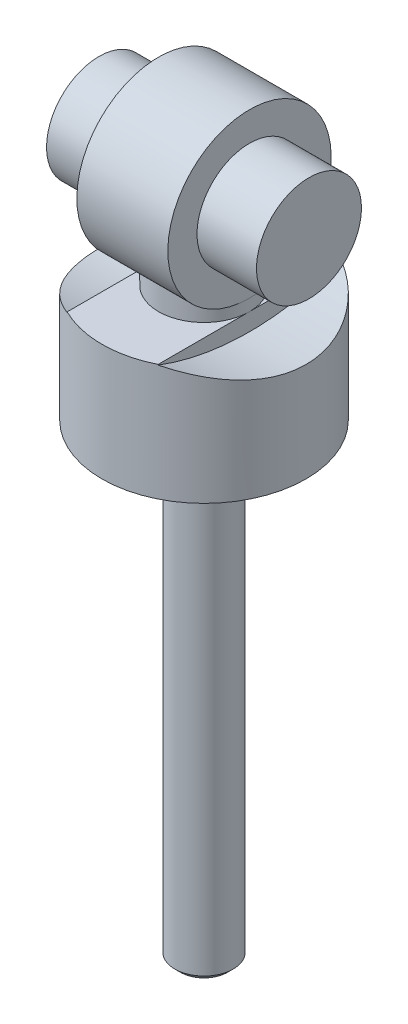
ISO-10303-21;
HEADER;
FILE_DESCRIPTION(('STEP AP214'),'2;1');
FILE_NAME('part.step','',(''),(''),'','','');
FILE_SCHEMA(('AUTOMOTIVE_DESIGN { 1 0 10303 214 1 1 1 1 }'));
ENDSEC;
DATA;
#1=APPLICATION_CONTEXT('core data for automotive mechanical design processes');
#2=APPLICATION_PROTOCOL_DEFINITION('international standard','automotive_design',2000,#1);
#3=PRODUCT_CONTEXT('',#1,'mechanical');
#4=PRODUCT('Part','Part','',(#3));
#5=PRODUCT_RELATED_PRODUCT_CATEGORY('part','',(#4));
#6=PRODUCT_DEFINITION_FORMATION('','',#4);
#7=PRODUCT_DEFINITION_CONTEXT('part definition',#1,'design');
#8=PRODUCT_DEFINITION('design','',#6,#7);
#9=PRODUCT_DEFINITION_SHAPE('','',#8);
#10=(LENGTH_UNIT() NAMED_UNIT(*) SI_UNIT(.MILLI.,.METRE.));
#11=(NAMED_UNIT(*) PLANE_ANGLE_UNIT() SI_UNIT($,.RADIAN.));
#12=(NAMED_UNIT(*) SI_UNIT($,.STERADIAN.) SOLID_ANGLE_UNIT());
#13=UNCERTAINTY_MEASURE_WITH_UNIT(LENGTH_MEASURE(1.E-05),#10,'distance_accuracy_value','');
#14=(GEOMETRIC_REPRESENTATION_CONTEXT(3) GLOBAL_UNCERTAINTY_ASSIGNED_CONTEXT((#13)) GLOBAL_UNIT_ASSIGNED_CONTEXT((#10,
#11,#12)) REPRESENTATION_CONTEXT('',''));
#15=CARTESIAN_POINT('',(0.,0.,0.));
#16=DIRECTION('',(0.,0.,1.));
#17=DIRECTION('',(1.,0.,0.));
#18=AXIS2_PLACEMENT_3D('',#15,#16,#17);
#19=CARTESIAN_POINT('',(0.,-18.,0.));
#20=DIRECTION('',(0.,-1.,0.));
#21=DIRECTION('',(0.,0.,-1.));
#22=AXIS2_PLACEMENT_3D('',#19,#20,#21);
#23=CYLINDRICAL_SURFACE('',#22,8.75);
#24=CARTESIAN_POINT('',(0.,-18.,0.));
#25=DIRECTION('',(0.,-1.,0.));
#26=DIRECTION('',(0.,0.,-1.));
#27=AXIS2_PLACEMENT_3D('',#24,#25,#26);
#28=CIRCLE('',#27,8.75);
#29=CARTESIAN_POINT('',(0.,-18.,-8.75));
#30=VERTEX_POINT('',#29);
#31=EDGE_CURVE('E154',#30,#30,#28,.T.);
#32=ORIENTED_EDGE('',*,*,#31,.F.);
#33=EDGE_LOOP('',(#32));
#34=FACE_BOUND('',#33,.T.);
#35=DIRECTION('',(0.,-1.,0.));
#36=VECTOR('',#35,1.);
#37=CARTESIAN_POINT('',(3.9,-18.,7.83278366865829));
#38=LINE('',#37,#36);
#39=CARTESIAN_POINT('',(3.9,-8.,7.83278366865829));
#40=VERTEX_POINT('',#39);
#41=CARTESIAN_POINT('',(3.9,-8.05467298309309,7.83278366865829));
#42=VERTEX_POINT('',#41);
#43=EDGE_CURVE('E158',#40,#42,#38,.T.);
#44=ORIENTED_EDGE('',*,*,#43,.F.);
#45=CARTESIAN_POINT('',(0.,-8.,0.));
#46=DIRECTION('',(0.,-1.,0.));
#47=DIRECTION('',(0.,0.,-1.));
#48=AXIS2_PLACEMENT_3D('',#45,#46,#47);
#49=CIRCLE('',#48,8.75);
#50=CARTESIAN_POINT('',(-3.9,-8.,7.83278366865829));
#51=VERTEX_POINT('',#50);
#52=EDGE_CURVE('E161',#40,#51,#49,.T.);
#53=ORIENTED_EDGE('',*,*,#52,.T.);
#54=DIRECTION('',(0.,-1.,0.));
#55=VECTOR('',#54,1.);
#56=CARTESIAN_POINT('',(-3.9,-18.,7.83278366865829));
#57=LINE('',#56,#55);
#58=CARTESIAN_POINT('',(-3.9,-8.05467298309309,7.83278366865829));
#59=VERTEX_POINT('',#58);
#60=EDGE_CURVE('E252',#59,#51,#57,.F.);
#61=ORIENTED_EDGE('',*,*,#60,.F.);
#62=CARTESIAN_POINT('',(-3.9,-8.05467298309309,-7.83278366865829));
#63=CARTESIAN_POINT('',(-4.12452384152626,-8.09737217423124,-7.721006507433));
#64=CARTESIAN_POINT('',(-4.34380093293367,-8.1426514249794,-7.5997666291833));
#65=CARTESIAN_POINT('',(-4.77055982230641,-8.23689755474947,-7.33939091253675));
#66=CARTESIAN_POINT('',(-4.97804428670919,-8.28586359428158,-7.20025914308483));
#67=CARTESIAN_POINT('',(-5.38011565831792,-8.38605555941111,-6.90500663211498));
#68=CARTESIAN_POINT('',(-5.57469632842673,-8.43728255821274,-6.74887776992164));
#69=CARTESIAN_POINT('',(-5.94972754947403,-8.54050248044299,-6.42069527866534));
#70=CARTESIAN_POINT('',(-6.13017736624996,-8.59249544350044,-6.24864082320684));
#71=CARTESIAN_POINT('',(-6.4758207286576,-8.69578877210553,-5.88967916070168));
#72=CARTESIAN_POINT('',(-6.64101593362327,-8.74708921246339,-5.7027735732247));
#73=CARTESIAN_POINT('',(-6.95509462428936,-8.8475918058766,-5.31520163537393));
#74=CARTESIAN_POINT('',(-7.10397859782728,-8.89679402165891,-5.11453569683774));
#75=CARTESIAN_POINT('',(-7.3843624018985,-8.99174565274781,-4.70065534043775));
#76=CARTESIAN_POINT('',(-7.51586399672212,-9.03749541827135,-4.4874421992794));
#77=CARTESIAN_POINT('',(-7.76039107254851,-9.12425375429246,-4.04988941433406));
#78=CARTESIAN_POINT('',(-7.87342610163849,-9.16526477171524,-3.82555559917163));
#79=CARTESIAN_POINT('',(-8.07907473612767,-9.24103260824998,-3.36942343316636));
#80=CARTESIAN_POINT('',(-8.17187940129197,-9.2758473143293,-3.13772094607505));
#81=CARTESIAN_POINT('',(-8.33757753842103,-9.33872146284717,-2.66640099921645));
#82=CARTESIAN_POINT('',(-8.41047104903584,-9.36678091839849,-2.42678355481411));
#83=CARTESIAN_POINT('',(-8.5355569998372,-9.41531310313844,-1.94152657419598));
#84=CARTESIAN_POINT('',(-8.58775595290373,-9.43578821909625,-1.69588895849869));
#85=CARTESIAN_POINT('',(-8.67089101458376,-9.46854701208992,-1.2005061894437));
#86=CARTESIAN_POINT('',(-8.70182846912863,-9.48083120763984,-0.950761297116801));
#87=CARTESIAN_POINT('',(-8.7407495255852,-9.49630702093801,-0.4658358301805));
#88=CARTESIAN_POINT('',(-8.750113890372,-9.50004546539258,-0.2307824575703));
#89=CARTESIAN_POINT('',(-8.7498840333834,-9.49995370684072,0.239307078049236));
#90=CARTESIAN_POINT('',(-8.7402907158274,-9.49612386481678,0.474343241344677));
#91=CARTESIAN_POINT('',(-8.70225130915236,-9.48100009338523,0.942599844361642));
#92=CARTESIAN_POINT('',(-8.67380828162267,-9.46970737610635,1.17582057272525));
#93=CARTESIAN_POINT('',(-8.59836743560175,-9.43996057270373,1.63877460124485));
#94=CARTESIAN_POINT('',(-8.55136958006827,-9.42150647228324,1.86850789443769));
#95=CARTESIAN_POINT('',(-8.44061471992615,-9.37843869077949,2.31748063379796));
#96=CARTESIAN_POINT('',(-8.37728079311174,-9.35398116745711,2.53683975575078));
#97=CARTESIAN_POINT('',(-8.23390957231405,-9.29929221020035,2.96937079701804));
#98=CARTESIAN_POINT('',(-8.153866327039,-9.26905871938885,3.18254048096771));
#99=CARTESIAN_POINT('',(-7.9777519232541,-9.20354769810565,3.60132955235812));
#100=CARTESIAN_POINT('',(-7.88168151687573,-9.16827040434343,3.80694929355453));
#101=CARTESIAN_POINT('',(-7.67419463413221,-9.09348021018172,4.2095784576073));
#102=CARTESIAN_POINT('',(-7.56277248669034,-9.05396574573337,4.40658466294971));
#103=CARTESIAN_POINT('',(-7.31951823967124,-8.96958509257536,4.80034457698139));
#104=CARTESIAN_POINT('',(-7.18695156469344,-8.92455123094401,4.99660873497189));
#105=CARTESIAN_POINT('',(-6.90662819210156,-8.83192026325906,5.37744590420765));
#106=CARTESIAN_POINT('',(-6.75886512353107,-8.78432208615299,5.5620139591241));
#107=CARTESIAN_POINT('',(-6.4491916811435,-8.68777999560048,5.91828375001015));
#108=CARTESIAN_POINT('',(-6.28729068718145,-8.63883698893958,6.08999387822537));
#109=CARTESIAN_POINT('',(-5.95018583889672,-8.54078643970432,6.4197690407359));
#110=CARTESIAN_POINT('',(-5.77497970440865,-8.4916788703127,6.5778317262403));
#111=CARTESIAN_POINT('',(-5.33439681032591,-8.37371263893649,6.94407214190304));
#112=CARTESIAN_POINT('',(-5.06252636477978,-8.30539786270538,7.14473831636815));
#113=CARTESIAN_POINT('',(-4.63830883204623,-8.20738306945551,7.42139553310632));
#114=CARTESIAN_POINT('',(-4.49422811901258,-8.17546615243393,7.50952743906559));
#115=CARTESIAN_POINT('',(-4.20090392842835,-8.11353556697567,7.67746300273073));
#116=CARTESIAN_POINT('',(-4.05166060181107,-8.08352184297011,7.7572669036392));
#117=CARTESIAN_POINT('',(-3.9,-8.0546729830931,7.83278366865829));
#118=B_SPLINE_CURVE_WITH_KNOTS('',3,(#62,#63,#64,#65,#66,#67,#68,#69,#70,#71,#72,#73,#74,#75,
#76,#77,#78,#79,#80,#81,#82,#83,#84,#85,#86,#87,#88,#89,#90,#91,#92,#93,#94,#95,#96,#97,#98,#99,
#100,#101,#102,#103,#104,#105,#106,#107,#108,#109,#110,#111,#112,#113,#114,#115,#116,#117),
.UNSPECIFIED.,.F.,.F.,(4,2,2,2,2,2,2,2,2,2,2,2,2,2,2,2,2,2,2,2,2,2,2,2,2,2,2,4),(0.,
0.762954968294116,1.5257367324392,2.28888454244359,3.0520719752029,3.81517629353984,
4.57825778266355,5.34126176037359,6.10386997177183,6.85892977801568,7.61398811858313,
8.36880864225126,9.1235813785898,9.82851622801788,10.5334174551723,11.2382042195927,
11.9429923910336,12.6310960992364,13.3194453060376,14.0077622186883,14.6963340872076,
15.4187923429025,16.14155472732,16.8638411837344,17.5862517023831,18.6179068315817,
19.1333253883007,19.6487288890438),.UNSPECIFIED.);
#119=CARTESIAN_POINT('',(-3.9,-8.05467298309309,-7.83278366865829));
#120=VERTEX_POINT('',#119);
#121=EDGE_CURVE('E109',#120,#59,#118,.T.);
#122=ORIENTED_EDGE('',*,*,#121,.F.);
#123=DIRECTION('',(0.,-1.,0.));
#124=VECTOR('',#123,1.);
#125=CARTESIAN_POINT('',(-3.9,-18.,-7.83278366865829));
#126=LINE('',#125,#124);
#127=CARTESIAN_POINT('',(-3.9,-8.,-7.83278366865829));
#128=VERTEX_POINT('',#127);
#129=EDGE_CURVE('E247',#128,#120,#126,.T.);
#130=ORIENTED_EDGE('',*,*,#129,.F.);
#131=CARTESIAN_POINT('',(3.9,-8.,-7.83278366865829));
#132=VERTEX_POINT('',#131);
#133=EDGE_CURVE('E172',#128,#132,#49,.T.);
#134=ORIENTED_EDGE('',*,*,#133,.T.);
#135=DIRECTION('',(0.,-1.,0.));
#136=VECTOR('',#135,1.);
#137=CARTESIAN_POINT('',(3.9,-18.,-7.83278366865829));
#138=LINE('',#137,#136);
#139=CARTESIAN_POINT('',(3.9,-8.05467298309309,-7.83278366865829));
#140=VERTEX_POINT('',#139);
#141=EDGE_CURVE('E165',#140,#132,#138,.F.);
#142=ORIENTED_EDGE('',*,*,#141,.F.);
#143=CARTESIAN_POINT('',(3.9,-8.05467298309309,7.83278366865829));
#144=CARTESIAN_POINT('',(4.12452384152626,-8.09737217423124,7.721006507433));
#145=CARTESIAN_POINT('',(4.34380093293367,-8.1426514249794,7.5997666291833));
#146=CARTESIAN_POINT('',(4.77055982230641,-8.23689755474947,7.33939091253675));
#147=CARTESIAN_POINT('',(4.97804428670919,-8.28586359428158,7.20025914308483));
#148=CARTESIAN_POINT('',(5.38011565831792,-8.38605555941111,6.90500663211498));
#149=CARTESIAN_POINT('',(5.57469632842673,-8.43728255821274,6.74887776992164));
#150=CARTESIAN_POINT('',(5.94972754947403,-8.54050248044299,6.42069527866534));
#151=CARTESIAN_POINT('',(6.13017736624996,-8.59249544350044,6.24864082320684));
#152=CARTESIAN_POINT('',(6.4758207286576,-8.69578877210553,5.88967916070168));
#153=CARTESIAN_POINT('',(6.64101593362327,-8.74708921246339,5.7027735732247));
#154=CARTESIAN_POINT('',(6.95509462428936,-8.8475918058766,5.31520163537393));
#155=CARTESIAN_POINT('',(7.10397859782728,-8.89679402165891,5.11453569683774));
#156=CARTESIAN_POINT('',(7.3843624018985,-8.99174565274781,4.70065534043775));
#157=CARTESIAN_POINT('',(7.51586399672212,-9.03749541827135,4.4874421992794));
#158=CARTESIAN_POINT('',(7.76039107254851,-9.12425375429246,4.04988941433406));
#159=CARTESIAN_POINT('',(7.87342610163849,-9.16526477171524,3.82555559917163));
#160=CARTESIAN_POINT('',(8.07907473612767,-9.24103260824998,3.36942343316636));
#161=CARTESIAN_POINT('',(8.17187940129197,-9.2758473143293,3.13772094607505));
#162=CARTESIAN_POINT('',(8.33757753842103,-9.33872146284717,2.66640099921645));
#163=CARTESIAN_POINT('',(8.41047104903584,-9.36678091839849,2.42678355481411));
#164=CARTESIAN_POINT('',(8.5355569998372,-9.41531310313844,1.94152657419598));
#165=CARTESIAN_POINT('',(8.58775595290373,-9.43578821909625,1.69588895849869));
#166=CARTESIAN_POINT('',(8.67089101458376,-9.46854701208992,1.2005061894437));
#167=CARTESIAN_POINT('',(8.70182846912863,-9.48083120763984,0.950761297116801));
#168=CARTESIAN_POINT('',(8.7407495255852,-9.49630702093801,0.4658358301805));
#169=CARTESIAN_POINT('',(8.750113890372,-9.50004546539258,0.2307824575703));
#170=CARTESIAN_POINT('',(8.7498840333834,-9.49995370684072,-0.239307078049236));
#171=CARTESIAN_POINT('',(8.7402907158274,-9.49612386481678,-0.474343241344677));
#172=CARTESIAN_POINT('',(8.70225130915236,-9.48100009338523,-0.942599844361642));
#173=CARTESIAN_POINT('',(8.67380828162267,-9.46970737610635,-1.17582057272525));
#174=CARTESIAN_POINT('',(8.59836743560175,-9.43996057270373,-1.63877460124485));
#175=CARTESIAN_POINT('',(8.55136958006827,-9.42150647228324,-1.86850789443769));
#176=CARTESIAN_POINT('',(8.44061471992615,-9.37843869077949,-2.31748063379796));
#177=CARTESIAN_POINT('',(8.37728079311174,-9.35398116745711,-2.53683975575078));
#178=CARTESIAN_POINT('',(8.23390957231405,-9.29929221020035,-2.96937079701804));
#179=CARTESIAN_POINT('',(8.153866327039,-9.26905871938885,-3.18254048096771));
#180=CARTESIAN_POINT('',(7.9777519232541,-9.20354769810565,-3.60132955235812));
#181=CARTESIAN_POINT('',(7.88168151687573,-9.16827040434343,-3.80694929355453));
#182=CARTESIAN_POINT('',(7.67419463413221,-9.09348021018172,-4.2095784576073));
#183=CARTESIAN_POINT('',(7.56277248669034,-9.05396574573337,-4.40658466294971));
#184=CARTESIAN_POINT('',(7.31951823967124,-8.96958509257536,-4.80034457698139));
#185=CARTESIAN_POINT('',(7.18695156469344,-8.92455123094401,-4.99660873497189));
#186=CARTESIAN_POINT('',(6.90662819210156,-8.83192026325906,-5.37744590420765));
#187=CARTESIAN_POINT('',(6.75886512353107,-8.78432208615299,-5.5620139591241));
#188=CARTESIAN_POINT('',(6.4491916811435,-8.68777999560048,-5.91828375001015));
#189=CARTESIAN_POINT('',(6.28729068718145,-8.63883698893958,-6.08999387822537));
#190=CARTESIAN_POINT('',(5.95018583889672,-8.54078643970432,-6.4197690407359));
#191=CARTESIAN_POINT('',(5.77497970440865,-8.4916788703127,-6.5778317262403));
#192=CARTESIAN_POINT('',(5.33439681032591,-8.37371263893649,-6.94407214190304));
#193=CARTESIAN_POINT('',(5.06252636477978,-8.30539786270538,-7.14473831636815));
#194=CARTESIAN_POINT('',(4.63830883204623,-8.20738306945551,-7.42139553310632));
#195=CARTESIAN_POINT('',(4.49422811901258,-8.17546615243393,-7.50952743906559));
#196=CARTESIAN_POINT('',(4.20090392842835,-8.11353556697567,-7.67746300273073));
#197=CARTESIAN_POINT('',(4.05166060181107,-8.08352184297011,-7.7572669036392));
#198=CARTESIAN_POINT('',(3.9,-8.0546729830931,-7.83278366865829));
#199=B_SPLINE_CURVE_WITH_KNOTS('',3,(#143,#144,#145,#146,#147,#148,#149,#150,#151,#152,#153,
#154,#155,#156,#157,#158,#159,#160,#161,#162,#163,#164,#165,#166,#167,#168,#169,#170,#171,#172,
#173,#174,#175,#176,#177,#178,#179,#180,#181,#182,#183,#184,#185,#186,#187,#188,#189,#190,#191,
#192,#193,#194,#195,#196,#197,#198),.UNSPECIFIED.,.F.,.F.,(4,2,2,2,2,2,2,2,2,2,2,2,2,2,2,2,2,2,
2,2,2,2,2,2,2,2,2,4),(0.,0.762954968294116,1.5257367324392,2.28888454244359,3.0520719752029,
3.81517629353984,4.57825778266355,5.34126176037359,6.10386997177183,6.85892977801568,
7.61398811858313,8.36880864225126,9.1235813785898,9.82851622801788,10.5334174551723,
11.2382042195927,11.9429923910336,12.6310960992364,13.3194453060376,14.0077622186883,
14.6963340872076,15.4187923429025,16.14155472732,16.8638411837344,17.5862517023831,
18.6179068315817,19.1333253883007,19.6487288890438),.UNSPECIFIED.);
#200=EDGE_CURVE('E98',#42,#140,#199,.T.);
#201=ORIENTED_EDGE('',*,*,#200,.F.);
#202=EDGE_LOOP('',(#44,#53,#61,#122,#130,#134,#142,#201));
#203=FACE_BOUND('',#202,.T.);
#204=ADVANCED_FACE('F15',(#34,#203),#23,.T.);
#205=CARTESIAN_POINT('',(0.,-8.,-3.9));
#206=DIRECTION('',(0.,-1.,0.));
#207=DIRECTION('',(0.,0.,-1.));
#208=AXIS2_PLACEMENT_3D('',#205,#206,#207);
#209=PLANE('',#208);
#210=DIRECTION('',(0.,0.,1.));
#211=VECTOR('',#210,1.);
#212=CARTESIAN_POINT('',(3.9,-8.,-3.9));
#213=LINE('',#212,#211);
#214=CARTESIAN_POINT('',(3.9,-8.,0.));
#215=VERTEX_POINT('',#214);
#216=EDGE_CURVE('E170',#215,#40,#213,.T.);
#217=ORIENTED_EDGE('',*,*,#216,.F.);
#218=CARTESIAN_POINT('',(0.,-8.,0.));
#219=DIRECTION('',(0.,-1.,0.));
#220=DIRECTION('',(0.,0.,-1.));
#221=AXIS2_PLACEMENT_3D('',#218,#219,#220);
#222=CIRCLE('',#221,3.9);
#223=CARTESIAN_POINT('',(-3.9,-8.,0.));
#224=VERTEX_POINT('',#223);
#225=EDGE_CURVE('E175',#215,#224,#222,.T.);
#226=ORIENTED_EDGE('',*,*,#225,.T.);
#227=DIRECTION('',(0.,0.,-1.));
#228=VECTOR('',#227,1.);
#229=CARTESIAN_POINT('',(-3.9,-8.,-3.9));
#230=LINE('',#229,#228);
#231=EDGE_CURVE('E171',#51,#224,#230,.T.);
#232=ORIENTED_EDGE('',*,*,#231,.F.);
#233=ORIENTED_EDGE('',*,*,#52,.F.);
#234=EDGE_LOOP('',(#217,#226,#232,#233));
#235=FACE_BOUND('',#234,.T.);
#236=ADVANCED_FACE('F144',(#235),#209,.F.);
#237=EDGE_CURVE('E251',#224,#128,#230,.T.);
#238=ORIENTED_EDGE('',*,*,#237,.F.);
#239=EDGE_CURVE('E37',#224,#215,#222,.T.);
#240=ORIENTED_EDGE('',*,*,#239,.T.);
#241=EDGE_CURVE('E260',#132,#215,#213,.T.);
#242=ORIENTED_EDGE('',*,*,#241,.F.);
#243=ORIENTED_EDGE('',*,*,#133,.F.);
#244=EDGE_LOOP('',(#238,#240,#242,#243));
#245=FACE_BOUND('',#244,.T.);
#246=ADVANCED_FACE('F149',(#245),#209,.F.);
#247=CARTESIAN_POINT('',(3.9,0.,0.));
#248=DIRECTION('',(1.,0.,0.));
#249=DIRECTION('',(0.,0.,-1.));
#250=AXIS2_PLACEMENT_3D('',#247,#248,#249);
#251=CYLINDRICAL_SURFACE('',#250,7.);
#252=CARTESIAN_POINT('',(-3.9,-7.,0.));
#253=CARTESIAN_POINT('',(-3.90000031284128,-7.0000002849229,0.101146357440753));
#254=CARTESIAN_POINT('',(-3.89606076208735,-6.99780299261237,0.202288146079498));
#255=CARTESIAN_POINT('',(-3.8803553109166,-6.98907110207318,0.4038084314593));
#256=CARTESIAN_POINT('',(-3.86858664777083,-6.98253497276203,0.504186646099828));
#257=CARTESIAN_POINT('',(-3.83737541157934,-6.96529106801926,0.70335165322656));
#258=CARTESIAN_POINT('',(-3.81793498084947,-6.95458445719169,0.802138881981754));
#259=CARTESIAN_POINT('',(-3.77162646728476,-6.92927102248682,0.997460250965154));
#260=CARTESIAN_POINT('',(-3.74475533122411,-6.91466259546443,1.09399344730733));
#261=CARTESIAN_POINT('',(-3.65367488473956,-6.8656158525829,1.37844239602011));
#262=CARTESIAN_POINT('',(-3.57884423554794,-6.82586770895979,1.56217036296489));
#263=CARTESIAN_POINT('',(-3.40371798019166,-6.73570207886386,1.91400928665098));
#264=CARTESIAN_POINT('',(-3.30341621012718,-6.68528201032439,2.08211644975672));
#265=CARTESIAN_POINT('',(-3.07231715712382,-6.57405157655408,2.41123481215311));
#266=CARTESIAN_POINT('',(-2.93988015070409,-6.51276165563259,2.57093203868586));
#267=CARTESIAN_POINT('',(-2.65187991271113,-6.38792749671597,2.86710248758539));
#268=CARTESIAN_POINT('',(-2.4962931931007,-6.32438101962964,3.00355181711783));
#269=CARTESIAN_POINT('',(-2.14756313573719,-6.19461051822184,3.26342871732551));
#270=CARTESIAN_POINT('',(-1.9522073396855,-6.12877524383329,3.38410558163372));
#271=CARTESIAN_POINT('',(-1.54017690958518,-6.01028349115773,3.59036592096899));
#272=CARTESIAN_POINT('',(-1.32353352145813,-5.95760808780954,3.67599990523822));
#273=CARTESIAN_POINT('',(-0.922013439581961,-5.88301311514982,3.79393677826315));
#274=CARTESIAN_POINT('',(-0.740093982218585,-5.85694711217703,3.83368428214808));
#275=CARTESIAN_POINT('',(-0.370897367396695,-5.82184998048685,3.88678839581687));
#276=CARTESIAN_POINT('',(-0.183625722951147,-5.81280192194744,3.9001712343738));
#277=CARTESIAN_POINT('',(0.191083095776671,-5.81303377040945,3.89982520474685));
#278=CARTESIAN_POINT('',(0.37852022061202,-5.8223342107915,3.8860659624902));
#279=CARTESIAN_POINT('',(0.747931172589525,-5.85794372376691,3.83216617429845));
#280=CARTESIAN_POINT('',(0.92990134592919,-5.88426391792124,3.79200837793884));
#281=CARTESIAN_POINT('',(1.28390008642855,-5.95046957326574,3.68723511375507));
#282=CARTESIAN_POINT('',(1.45593022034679,-5.99035288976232,3.62262351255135));
#283=CARTESIAN_POINT('',(1.78727171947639,-6.07937613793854,3.47115130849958));
#284=CARTESIAN_POINT('',(1.94657809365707,-6.12851967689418,3.3842820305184));
#285=CARTESIAN_POINT('',(2.2737904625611,-6.23962592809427,3.17538598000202));
#286=CARTESIAN_POINT('',(2.43929114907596,-6.30240002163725,3.05001538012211));
#287=CARTESIAN_POINT('',(2.74839589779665,-6.4283539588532,2.77475098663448));
#288=CARTESIAN_POINT('',(2.89198236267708,-6.49153408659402,2.62483768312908));
#289=CARTESIAN_POINT('',(3.16801707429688,-6.61889865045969,2.28605157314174));
#290=CARTESIAN_POINT('',(3.29781181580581,-6.68252127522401,2.09475977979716));
#291=CARTESIAN_POINT('',(3.46646074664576,-6.76786771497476,1.79084562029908));
#292=CARTESIAN_POINT('',(3.51835131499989,-6.79464354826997,1.68666859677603));
#293=CARTESIAN_POINT('',(3.612893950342,-6.84407556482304,1.47329042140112));
#294=CARTESIAN_POINT('',(3.65555155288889,-6.8667342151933,1.36409232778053));
#295=CARTESIAN_POINT('',(3.72840544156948,-6.90580423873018,1.14932095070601));
#296=CARTESIAN_POINT('',(3.75926673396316,-6.92254271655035,1.04403213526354));
#297=CARTESIAN_POINT('',(3.81209300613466,-6.95137123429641,0.830670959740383));
#298=CARTESIAN_POINT('',(3.83406268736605,-6.96346373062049,0.722600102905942));
#299=CARTESIAN_POINT('',(3.868792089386,-6.9826458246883,0.504603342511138));
#300=CARTESIAN_POINT('',(3.88155641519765,-6.9897379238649,0.394678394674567));
#301=CARTESIAN_POINT('',(3.89769038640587,-6.99871019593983,0.173933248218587));
#302=CARTESIAN_POINT('',(3.90106096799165,-7.00059088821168,0.0631131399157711));
#303=CARTESIAN_POINT('',(3.89851220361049,-6.9991712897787,-0.145684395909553));
#304=CARTESIAN_POINT('',(3.8936119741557,-6.99643934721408,-0.243680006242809));
#305=CARTESIAN_POINT('',(3.87646786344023,-6.98691292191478,-0.438858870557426));
#306=CARTESIAN_POINT('',(3.86422167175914,-6.98011716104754,-0.536041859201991));
#307=CARTESIAN_POINT('',(3.8325365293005,-6.96262599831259,-0.728834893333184));
#308=CARTESIAN_POINT('',(3.81310029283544,-6.95193206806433,-0.824445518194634));
#309=CARTESIAN_POINT('',(3.7672642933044,-6.92689811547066,-1.01350789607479));
#310=CARTESIAN_POINT('',(3.7408618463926,-6.91255668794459,-1.10695880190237));
#311=CARTESIAN_POINT('',(3.65188020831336,-6.86467000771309,-1.38231185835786));
#312=CARTESIAN_POINT('',(3.5793522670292,-6.82616282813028,-1.56025439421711));
#313=CARTESIAN_POINT('',(3.41035528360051,-6.73908732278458,-1.90153537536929));
#314=CARTESIAN_POINT('',(3.31387989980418,-6.69051633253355,-2.06486993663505));
#315=CARTESIAN_POINT('',(3.0884274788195,-6.58161394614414,-2.39055758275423));
#316=CARTESIAN_POINT('',(2.95712331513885,-6.52058610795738,-2.5510686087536));
#317=CARTESIAN_POINT('',(2.67130243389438,-6.39603792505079,-2.8490076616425));
#318=CARTESIAN_POINT('',(2.51676008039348,-6.33251488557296,-2.98640983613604));
#319=CARTESIAN_POINT('',(2.17019140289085,-6.20252665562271,-3.24840604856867));
#320=CARTESIAN_POINT('',(1.97595074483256,-6.13642030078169,-3.37027211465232));
#321=CARTESIAN_POINT('',(1.5660225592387,-6.0169979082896,-3.57914696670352));
#322=CARTESIAN_POINT('',(1.35036576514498,-5.96366390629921,-3.66620482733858));
#323=CARTESIAN_POINT('',(0.949863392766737,-5.88745193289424,-3.78707116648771));
#324=CARTESIAN_POINT('',(0.767997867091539,-5.86053840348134,-3.82820584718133));
#325=CARTESIAN_POINT('',(0.398636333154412,-5.82368322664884,-3.88405483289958));
#326=CARTESIAN_POINT('',(0.211146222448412,-5.81372439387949,-3.89879589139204));
#327=CARTESIAN_POINT('',(-0.16431738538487,-5.81220321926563,-3.90106353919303));
#328=CARTESIAN_POINT('',(-0.352291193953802,-5.82066508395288,-3.88855431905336));
#329=CARTESIAN_POINT('',(-0.722985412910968,-5.85478864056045,-3.83697351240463));
#330=CARTESIAN_POINT('',(-0.905702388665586,-5.88046132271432,-3.79788495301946));
#331=CARTESIAN_POINT('',(-1.26056326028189,-5.94547234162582,-3.69526481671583));
#332=CARTESIAN_POINT('',(-1.43274964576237,-5.98475081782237,-3.63184018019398));
#333=CARTESIAN_POINT('',(-1.76456240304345,-6.07272836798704,-3.48273610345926));
#334=CARTESIAN_POINT('',(-1.92418392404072,-6.12143105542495,-3.39704812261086));
#335=CARTESIAN_POINT('',(-2.25197054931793,-6.23169761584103,-3.1908552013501));
#336=CARTESIAN_POINT('',(-2.41778139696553,-6.29409283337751,-3.06704558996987));
#337=CARTESIAN_POINT('',(-2.72777488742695,-6.41955139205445,-2.79497203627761));
#338=CARTESIAN_POINT('',(-2.87193982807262,-6.48261523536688,-2.64668828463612));
#339=CARTESIAN_POINT('',(-3.14998913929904,-6.61026335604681,-2.31081364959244));
#340=CARTESIAN_POINT('',(-3.28116085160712,-6.67429932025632,-2.12072173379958));
#341=CARTESIAN_POINT('',(-3.45204991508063,-6.76049282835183,-1.81846116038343));
#342=CARTESIAN_POINT('',(-3.50471596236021,-6.787588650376,-1.71481303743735));
#343=CARTESIAN_POINT('',(-3.60086999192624,-6.83773159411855,-1.5024293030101));
#344=CARTESIAN_POINT('',(-3.64436349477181,-6.86078114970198,-1.39369680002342));
#345=CARTESIAN_POINT('',(-3.71848344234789,-6.90045090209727,-1.18090483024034));
#346=CARTESIAN_POINT('',(-3.74986495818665,-6.91743981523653,-1.07717625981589));
#347=CARTESIAN_POINT('',(-3.80397740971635,-6.94692221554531,-0.866908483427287));
#348=CARTESIAN_POINT('',(-3.8267128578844,-6.95941804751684,-0.760370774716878));
#349=CARTESIAN_POINT('',(-3.86321922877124,-6.97955808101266,-0.545364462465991));
#350=CARTESIAN_POINT('',(-3.87699416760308,-6.98720445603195,-0.436896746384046));
#351=CARTESIAN_POINT('',(-3.89538409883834,-6.99742510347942,-0.218950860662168));
#352=CARTESIAN_POINT('',(-3.89999966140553,-6.99999969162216,-0.109472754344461));
#353=CARTESIAN_POINT('',(-3.9,-7.,0.));
#354=B_SPLINE_CURVE_WITH_KNOTS('',3,(#252,#253,#254,#255,#256,#257,#258,#259,#260,#261,#262,
#263,#264,#265,#266,#267,#268,#269,#270,#271,#272,#273,#274,#275,#276,#277,#278,#279,#280,#281,
#282,#283,#284,#285,#286,#287,#288,#289,#290,#291,#292,#293,#294,#295,#296,#297,#298,#299,#300,
#301,#302,#303,#304,#305,#306,#307,#308,#309,#310,#311,#312,#313,#314,#315,#316,#317,#318,#319,
#320,#321,#322,#323,#324,#325,#326,#327,#328,#329,#330,#331,#332,#333,#334,#335,#336,#337,#338,
#339,#340,#341,#342,#343,#344,#345,#346,#347,#348,#349,#350,#351,#352,#353),.UNSPECIFIED.,.T.,
.F.,(4,2,2,2,2,2,2,2,2,2,2,2,2,2,2,2,2,2,2,2,2,2,2,2,2,2,2,2,2,2,2,2,2,2,2,2,2,2,2,2,2,2,2,2,2,
2,2,2,2,2,4),(0.,0.303330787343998,0.606768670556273,0.910121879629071,1.21359992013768,
1.81765602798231,2.42185845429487,3.06822728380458,3.71525645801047,4.42832801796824,
5.14036813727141,5.70199096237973,6.26305477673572,6.82474682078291,7.38680627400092,
7.94877689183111,8.51096687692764,9.15905767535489,9.80766618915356,10.5228095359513,
10.8806537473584,11.2382828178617,11.5707819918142,11.903105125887,12.2352618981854,
12.5673855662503,12.8614963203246,13.1556996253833,13.4497919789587,13.7439978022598,
14.3292696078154,14.9146965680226,15.5605601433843,16.2071415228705,16.9195476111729,
17.6309457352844,18.1936677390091,18.7558190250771,19.3187094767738,19.8819597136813,
20.4427626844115,21.0037811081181,21.6495812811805,22.2959067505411,23.0107914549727,
23.3684940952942,23.7259808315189,24.0546214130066,24.383090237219,24.7114117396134,
25.0397128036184),.UNSPECIFIED.);
#355=CARTESIAN_POINT('',(3.9,-7.,0.));
#356=VERTEX_POINT('',#355);
#357=CARTESIAN_POINT('',(-3.9,-7.,0.));
#358=VERTEX_POINT('',#357);
#359=EDGE_CURVE('E187',#356,#358,#354,.T.);
#360=ORIENTED_EDGE('',*,*,#359,.T.);
#361=CARTESIAN_POINT('',(-3.9,0.,0.));
#362=DIRECTION('',(1.,0.,0.));
#363=DIRECTION('',(0.,0.,-1.));
#364=AXIS2_PLACEMENT_3D('',#361,#362,#363);
#365=CIRCLE('',#364,7.);
#366=EDGE_CURVE('E179',#358,#358,#365,.T.);
#367=ORIENTED_EDGE('',*,*,#366,.T.);
#368=EDGE_CURVE('E193',#358,#356,#354,.T.);
#369=ORIENTED_EDGE('',*,*,#368,.T.);
#370=CARTESIAN_POINT('',(3.9,0.,0.));
#371=DIRECTION('',(1.,0.,0.));
#372=DIRECTION('',(0.,0.,-1.));
#373=AXIS2_PLACEMENT_3D('',#370,#371,#372);
#374=CIRCLE('',#373,7.);
#375=EDGE_CURVE('E182',#356,#356,#374,.T.);
#376=ORIENTED_EDGE('',*,*,#375,.F.);
#377=EDGE_LOOP('',(#360,#367,#369,#376));
#378=FACE_BOUND('',#377,.T.);
#379=ADVANCED_FACE('F194',(#378),#251,.T.);
#380=CARTESIAN_POINT('',(-3.9,7.,0.));
#381=DIRECTION('',(-1.,0.,0.));
#382=DIRECTION('',(0.,0.,1.));
#383=AXIS2_PLACEMENT_3D('',#380,#381,#382);
#384=PLANE('',#383);
#385=CARTESIAN_POINT('',(-3.9,0.,0.));
#386=DIRECTION('',(-1.,0.,0.));
#387=DIRECTION('',(0.,0.,1.));
#388=AXIS2_PLACEMENT_3D('',#385,#386,#387);
#389=CIRCLE('',#388,4.5);
#390=CARTESIAN_POINT('',(-3.9,0.,4.5));
#391=VERTEX_POINT('',#390);
#392=EDGE_CURVE('E279',#391,#391,#389,.F.);
#393=ORIENTED_EDGE('',*,*,#392,.T.);
#394=EDGE_LOOP('',(#393));
#395=FACE_BOUND('',#394,.T.);
#396=ORIENTED_EDGE('',*,*,#366,.F.);
#397=EDGE_LOOP('',(#396));
#398=FACE_BOUND('',#397,.T.);
#399=ADVANCED_FACE('F17',(#395,#398),#384,.T.);
#400=CARTESIAN_POINT('',(3.9,4.5,0.));
#401=DIRECTION('',(1.,0.,0.));
#402=DIRECTION('',(0.,0.,-1.));
#403=AXIS2_PLACEMENT_3D('',#400,#401,#402);
#404=PLANE('',#403);
#405=ORIENTED_EDGE('',*,*,#375,.T.);
#406=EDGE_LOOP('',(#405));
#407=FACE_BOUND('',#406,.T.);
#408=CARTESIAN_POINT('',(3.9,0.,0.));
#409=DIRECTION('',(1.,0.,0.));
#410=DIRECTION('',(0.,0.,-1.));
#411=AXIS2_PLACEMENT_3D('',#408,#409,#410);
#412=CIRCLE('',#411,4.5);
#413=CARTESIAN_POINT('',(3.9,0.,-4.5));
#414=VERTEX_POINT('',#413);
#415=EDGE_CURVE('E185',#414,#414,#412,.T.);
#416=ORIENTED_EDGE('',*,*,#415,.F.);
#417=EDGE_LOOP('',(#416));
#418=FACE_BOUND('',#417,.T.);
#419=ADVANCED_FACE('F130',(#407,#418),#404,.T.);
#420=CARTESIAN_POINT('',(0.,-18.,-8.75));
#421=DIRECTION('',(0.,1.,0.));
#422=DIRECTION('',(0.,0.,1.));
#423=AXIS2_PLACEMENT_3D('',#420,#421,#422);
#424=PLANE('',#423);
#425=CARTESIAN_POINT('',(0.,-18.,0.));
#426=DIRECTION('',(0.,-1.,0.));
#427=DIRECTION('',(0.,0.,-1.));
#428=AXIS2_PLACEMENT_3D('',#425,#426,#427);
#429=CIRCLE('',#428,2.5);
#430=CARTESIAN_POINT('',(0.,-18.,-2.5));
#431=VERTEX_POINT('',#430);
#432=EDGE_CURVE('E285',#431,#431,#429,.T.);
#433=ORIENTED_EDGE('',*,*,#432,.F.);
#434=EDGE_LOOP('',(#433));
#435=FACE_BOUND('',#434,.T.);
#436=ORIENTED_EDGE('',*,*,#31,.T.);
#437=EDGE_LOOP('',(#436));
#438=FACE_BOUND('',#437,.T.);
#439=ADVANCED_FACE('F127',(#435,#438),#424,.F.);
#440=CARTESIAN_POINT('',(0.,-18.,0.));
#441=DIRECTION('',(0.,-1.,0.));
#442=DIRECTION('',(0.,0.,-1.));
#443=AXIS2_PLACEMENT_3D('',#440,#441,#442);
#444=CYLINDRICAL_SURFACE('',#443,3.9);
#445=ORIENTED_EDGE('',*,*,#239,.F.);
#446=ORIENTED_EDGE('',*,*,#225,.F.);
#447=EDGE_LOOP('',(#445,#446));
#448=FACE_BOUND('',#447,.T.);
#449=ORIENTED_EDGE('',*,*,#359,.F.);
#450=ORIENTED_EDGE('',*,*,#368,.F.);
#451=EDGE_LOOP('',(#449,#450));
#452=FACE_BOUND('',#451,.T.);
#453=ADVANCED_FACE('F129',(#448,#452),#444,.T.);
#454=CARTESIAN_POINT('',(-3.9,9.4470989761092,0.));
#455=DIRECTION('',(-1.,0.,0.));
#456=DIRECTION('',(0.,0.,1.));
#457=AXIS2_PLACEMENT_3D('',#454,#455,#456);
#458=PLANE('',#457);
#459=ORIENTED_EDGE('',*,*,#129,.T.);
#460=CARTESIAN_POINT('',(-3.9,12.4470989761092,0.));
#461=DIRECTION('',(-1.,0.,0.));
#462=DIRECTION('',(0.,0.,1.));
#463=AXIS2_PLACEMENT_3D('',#460,#461,#462);
#464=CIRCLE('',#463,21.9470989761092);
#465=EDGE_CURVE('E92',#120,#59,#464,.T.);
#466=ORIENTED_EDGE('',*,*,#465,.T.);
#467=ORIENTED_EDGE('',*,*,#60,.T.);
#468=ORIENTED_EDGE('',*,*,#231,.T.);
#469=ORIENTED_EDGE('',*,*,#237,.T.);
#470=EDGE_LOOP('',(#459,#466,#467,#468,#469));
#471=FACE_BOUND('',#470,.T.);
#472=ADVANCED_FACE('F137',(#471),#458,.T.);
#473=CARTESIAN_POINT('',(-17.5,12.4470989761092,0.));
#474=DIRECTION('',(-1.,0.,0.));
#475=DIRECTION('',(0.,0.,1.));
#476=AXIS2_PLACEMENT_3D('',#473,#474,#475);
#477=CYLINDRICAL_SURFACE('',#476,21.9470989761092);
#478=ORIENTED_EDGE('',*,*,#465,.F.);
#479=ORIENTED_EDGE('',*,*,#121,.T.);
#480=EDGE_LOOP('',(#478,#479));
#481=FACE_BOUND('',#480,.T.);
#482=ADVANCED_FACE('F124',(#481),#477,.F.);
#483=CARTESIAN_POINT('',(-17.5,12.4470989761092,0.));
#484=DIRECTION('',(-1.,0.,0.));
#485=DIRECTION('',(0.,0.,1.));
#486=AXIS2_PLACEMENT_3D('',#483,#484,#485);
#487=CYLINDRICAL_SURFACE('',#486,21.9470989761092);
#488=CARTESIAN_POINT('',(3.9,12.4470989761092,0.));
#489=DIRECTION('',(-1.,0.,0.));
#490=DIRECTION('',(0.,0.,1.));
#491=AXIS2_PLACEMENT_3D('',#488,#489,#490);
#492=CIRCLE('',#491,21.9470989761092);
#493=EDGE_CURVE('E254',#140,#42,#492,.T.);
#494=ORIENTED_EDGE('',*,*,#493,.T.);
#495=ORIENTED_EDGE('',*,*,#200,.T.);
#496=EDGE_LOOP('',(#494,#495));
#497=FACE_BOUND('',#496,.T.);
#498=ADVANCED_FACE('F119',(#497),#487,.F.);
#499=CARTESIAN_POINT('',(3.9,-9.5,0.));
#500=DIRECTION('',(1.,0.,0.));
#501=DIRECTION('',(0.,0.,-1.));
#502=AXIS2_PLACEMENT_3D('',#499,#500,#501);
#503=PLANE('',#502);
#504=ORIENTED_EDGE('',*,*,#43,.T.);
#505=ORIENTED_EDGE('',*,*,#493,.F.);
#506=ORIENTED_EDGE('',*,*,#141,.T.);
#507=ORIENTED_EDGE('',*,*,#241,.T.);
#508=ORIENTED_EDGE('',*,*,#216,.T.);
#509=EDGE_LOOP('',(#504,#505,#506,#507,#508));
#510=FACE_BOUND('',#509,.T.);
#511=ADVANCED_FACE('F123',(#510),#503,.T.);
#512=CARTESIAN_POINT('',(9.,0.,0.));
#513=DIRECTION('',(1.,0.,0.));
#514=DIRECTION('',(0.,0.,-1.));
#515=AXIS2_PLACEMENT_3D('',#512,#513,#514);
#516=PLANE('',#515);
#517=CARTESIAN_POINT('',(9.,0.,0.));
#518=DIRECTION('',(1.,0.,0.));
#519=DIRECTION('',(0.,0.,-1.));
#520=AXIS2_PLACEMENT_3D('',#517,#518,#519);
#521=CIRCLE('',#520,4.5);
#522=CARTESIAN_POINT('',(9.,0.,-4.5));
#523=VERTEX_POINT('',#522);
#524=EDGE_CURVE('E277',#523,#523,#521,.T.);
#525=ORIENTED_EDGE('',*,*,#524,.T.);
#526=EDGE_LOOP('',(#525));
#527=FACE_BOUND('',#526,.T.);
#528=ADVANCED_FACE('F274',(#527),#516,.T.);
#529=CARTESIAN_POINT('',(9.,0.,0.));
#530=DIRECTION('',(-1.,0.,0.));
#531=DIRECTION('',(0.,0.,1.));
#532=AXIS2_PLACEMENT_3D('',#529,#530,#531);
#533=CYLINDRICAL_SURFACE('',#532,4.5);
#534=ORIENTED_EDGE('',*,*,#415,.T.);
#535=EDGE_LOOP('',(#534));
#536=FACE_BOUND('',#535,.T.);
#537=ORIENTED_EDGE('',*,*,#524,.F.);
#538=EDGE_LOOP('',(#537));
#539=FACE_BOUND('',#538,.T.);
#540=ADVANCED_FACE('F270',(#536,#539),#533,.T.);
#541=ORIENTED_EDGE('',*,*,#392,.F.);
#542=EDGE_LOOP('',(#541));
#543=FACE_BOUND('',#542,.T.);
#544=CARTESIAN_POINT('',(-9.,0.,0.));
#545=DIRECTION('',(1.,0.,0.));
#546=DIRECTION('',(0.,0.,-1.));
#547=AXIS2_PLACEMENT_3D('',#544,#545,#546);
#548=CIRCLE('',#547,4.5);
#549=CARTESIAN_POINT('',(-9.,0.,-4.5));
#550=VERTEX_POINT('',#549);
#551=EDGE_CURVE('E280',#550,#550,#548,.T.);
#552=ORIENTED_EDGE('',*,*,#551,.T.);
#553=EDGE_LOOP('',(#552));
#554=FACE_BOUND('',#553,.T.);
#555=ADVANCED_FACE('F273',(#543,#554),#533,.T.);
#556=CARTESIAN_POINT('',(-9.,0.,0.));
#557=DIRECTION('',(1.,0.,0.));
#558=DIRECTION('',(0.,0.,-1.));
#559=AXIS2_PLACEMENT_3D('',#556,#557,#558);
#560=PLANE('',#559);
#561=ORIENTED_EDGE('',*,*,#551,.F.);
#562=EDGE_LOOP('',(#561));
#563=FACE_BOUND('',#562,.T.);
#564=ADVANCED_FACE('F318',(#563),#560,.F.);
#565=CARTESIAN_POINT('',(0.,-58.,-2.0095));
#566=DIRECTION('',(0.,1.,0.));
#567=DIRECTION('',(0.,0.,1.));
#568=AXIS2_PLACEMENT_3D('',#565,#566,#567);
#569=PLANE('',#568);
#570=CARTESIAN_POINT('',(0.,-58.,0.));
#571=DIRECTION('',(0.,-1.,0.));
#572=DIRECTION('',(0.,0.,-1.));
#573=AXIS2_PLACEMENT_3D('',#570,#571,#572);
#574=CIRCLE('',#573,2.0095);
#575=CARTESIAN_POINT('',(0.,-58.,-2.0095));
#576=VERTEX_POINT('',#575);
#577=EDGE_CURVE('E293',#576,#576,#574,.T.);
#578=ORIENTED_EDGE('',*,*,#577,.T.);
#579=EDGE_LOOP('',(#578));
#580=FACE_BOUND('',#579,.T.);
#581=ADVANCED_FACE('F297',(#580),#569,.F.);
#582=CARTESIAN_POINT('',(0.,-57.5095,0.));
#583=DIRECTION('',(0.,1.,0.));
#584=DIRECTION('',(0.,0.,1.));
#585=AXIS2_PLACEMENT_3D('',#582,#583,#584);
#586=CONICAL_SURFACE('',#585,2.5,0.78539816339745);
#587=ORIENTED_EDGE('',*,*,#577,.F.);
#588=EDGE_LOOP('',(#587));
#589=FACE_BOUND('',#588,.T.);
#590=CARTESIAN_POINT('',(0.,-57.5095,0.));
#591=DIRECTION('',(0.,-1.,0.));
#592=DIRECTION('',(0.,0.,-1.));
#593=AXIS2_PLACEMENT_3D('',#590,#591,#592);
#594=CIRCLE('',#593,2.5);
#595=CARTESIAN_POINT('',(0.,-57.5095,-2.5));
#596=VERTEX_POINT('',#595);
#597=EDGE_CURVE('E290',#596,#596,#594,.T.);
#598=ORIENTED_EDGE('',*,*,#597,.T.);
#599=EDGE_LOOP('',(#598));
#600=FACE_BOUND('',#599,.T.);
#601=ADVANCED_FACE('F299',(#589,#600),#586,.T.);
#602=CARTESIAN_POINT('',(0.,-58.,0.));
#603=DIRECTION('',(0.,-1.,0.));
#604=DIRECTION('',(0.,0.,-1.));
#605=AXIS2_PLACEMENT_3D('',#602,#603,#604);
#606=CYLINDRICAL_SURFACE('',#605,2.5);
#607=ORIENTED_EDGE('',*,*,#597,.F.);
#608=EDGE_LOOP('',(#607));
#609=FACE_BOUND('',#608,.T.);
#610=ORIENTED_EDGE('',*,*,#432,.T.);
#611=EDGE_LOOP('',(#610));
#612=FACE_BOUND('',#611,.T.);
#613=ADVANCED_FACE('F302',(#609,#612),#606,.T.);
#614=CLOSED_SHELL('',(#204,#236,#246,#379,#399,#419,#439,#453,#472,#482,#498,#511,#528,#540,
#555,#564,#581,#601,#613));
#615=CARTESIAN_POINT('',(0.,-3.30870065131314,-3.05));
#616=CARTESIAN_POINT('',(0.0740543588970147,-3.30870135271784,-3.04999955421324));
#617=CARTESIAN_POINT('',(0.148113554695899,-3.31120079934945,-3.04729547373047));
#618=CARTESIAN_POINT('',(0.29550128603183,-3.32105327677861,-3.03655247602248));
#619=CARTESIAN_POINT('',(0.368829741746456,-3.32840683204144,-3.02851298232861));
#620=CARTESIAN_POINT('',(0.586950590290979,-3.35728100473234,-2.99658701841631));
#621=CARTESIAN_POINT('',(0.729787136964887,-3.385614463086,-2.96489335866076));
#622=CARTESIAN_POINT('',(1.00481607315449,-3.45535402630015,-2.88328172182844));
#623=CARTESIAN_POINT('',(1.13710040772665,-3.49662694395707,-2.83354864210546));
#624=CARTESIAN_POINT('',(1.39123632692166,-3.58733287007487,-2.71780374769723));
#625=CARTESIAN_POINT('',(1.51308617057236,-3.6367672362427,-2.65178922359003));
#626=CARTESIAN_POINT('',(1.76446479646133,-3.74781440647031,-2.49293203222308));
#627=CARTESIAN_POINT('',(1.89204410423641,-3.81010328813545,-2.39747643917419));
#628=CARTESIAN_POINT('',(2.13108358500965,-3.93428541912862,-2.18776550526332));
#629=CARTESIAN_POINT('',(2.24252540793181,-3.99617814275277,-2.07348907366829));
#630=CARTESIAN_POINT('',(2.46301512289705,-4.1236708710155,-1.80832137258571));
#631=CARTESIAN_POINT('',(2.56913328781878,-4.18840811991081,-1.65450535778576));
#632=CARTESIAN_POINT('',(2.70696690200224,-4.27480018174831,-1.40843177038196));
#633=CARTESIAN_POINT('',(2.74934801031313,-4.30180769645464,-1.3238668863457));
#634=CARTESIAN_POINT('',(2.82644155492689,-4.35148238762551,-1.15011183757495));
#635=CARTESIAN_POINT('',(2.86115705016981,-4.37415129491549,-1.06092353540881));
#636=CARTESIAN_POINT('',(2.93723315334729,-4.42421178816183,-0.834029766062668));
#637=CARTESIAN_POINT('',(2.97356864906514,-4.44850916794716,-0.693888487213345));
#638=CARTESIAN_POINT('',(3.02602447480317,-4.48374237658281,-0.408328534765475));
#639=CARTESIAN_POINT('',(3.04216027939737,-4.49468843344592,-0.262913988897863));
#640=CARTESIAN_POINT('',(3.05336718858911,-4.5022807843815,0.0293654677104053));
#641=CARTESIAN_POINT('',(3.04840293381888,-4.49890307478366,0.176232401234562));
#642=CARTESIAN_POINT('',(3.01761506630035,-4.47809945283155,0.466749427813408));
#643=CARTESIAN_POINT('',(2.99178532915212,-4.46066941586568,0.610398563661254));
#644=CARTESIAN_POINT('',(2.92131598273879,-4.41371882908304,0.888013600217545));
#645=CARTESIAN_POINT('',(2.87702540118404,-4.38442289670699,1.02210773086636));
#646=CARTESIAN_POINT('',(2.77159197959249,-4.31597239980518,1.28074304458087));
#647=CARTESIAN_POINT('',(2.71044594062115,-4.27681596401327,1.40528240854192));
#648=CARTESIAN_POINT('',(2.56551457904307,-4.18638203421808,1.65649516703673));
#649=CARTESIAN_POINT('',(2.47995424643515,-4.13423576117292,1.78182668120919));
#650=CARTESIAN_POINT('',(2.29260341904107,-4.02464324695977,2.01721180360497));
#651=CARTESIAN_POINT('',(2.19079412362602,-3.96719089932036,2.12724743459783));
#652=CARTESIAN_POINT('',(1.95420691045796,-3.841187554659,2.34819750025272));
#653=CARTESIAN_POINT('',(1.81676442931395,-3.7723979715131,2.4561343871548));
#654=CARTESIAN_POINT('',(1.52359640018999,-3.64029455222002,2.64798057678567));
#655=CARTESIAN_POINT('',(1.36788117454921,-3.57697765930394,2.7319033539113));
#656=CARTESIAN_POINT('',(1.07873972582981,-3.4781328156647,2.85610629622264));
#657=CARTESIAN_POINT('',(0.948783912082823,-3.43957561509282,2.90201639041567));
#658=CARTESIAN_POINT('',(0.680934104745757,-3.37555318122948,2.97625031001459));
#659=CARTESIAN_POINT('',(0.54305511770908,-3.35006405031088,3.00460625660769));
#660=CARTESIAN_POINT('',(0.261369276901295,-3.31605166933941,3.04212029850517));
#661=CARTESIAN_POINT('',(0.117523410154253,-3.30766771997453,3.05112079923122));
#662=CARTESIAN_POINT('',(-0.169846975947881,-3.30994043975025,3.04865479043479));
#663=CARTESIAN_POINT('',(-0.313371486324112,-3.32059763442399,3.03718771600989));
#664=CARTESIAN_POINT('',(-0.579273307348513,-3.35672225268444,2.99716587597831));
#665=CARTESIAN_POINT('',(-0.702224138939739,-3.3804057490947,2.97065905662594));
#666=CARTESIAN_POINT('',(-0.941707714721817,-3.43813602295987,2.9036484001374));
#667=CARTESIAN_POINT('',(-1.05823445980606,-3.47219229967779,2.86313172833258));
#668=CARTESIAN_POINT('',(-1.33453129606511,-3.56435394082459,2.74826045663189));
#669=CARTESIAN_POINT('',(-1.49008084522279,-3.62637602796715,2.6668870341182));
#670=CARTESIAN_POINT('',(-1.78349065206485,-3.75646016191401,2.48031899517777));
#671=CARTESIAN_POINT('',(-1.9213174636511,-3.82453323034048,2.37508034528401));
#672=CARTESIAN_POINT('',(-2.17938375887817,-3.9604362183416,2.14091948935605));
#673=CARTESIAN_POINT('',(-2.29935531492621,-4.02824992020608,2.01169148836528));
#674=CARTESIAN_POINT('',(-2.51660188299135,-4.1560914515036,1.7321777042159));
#675=CARTESIAN_POINT('',(-2.61391283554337,-4.21613154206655,1.58192588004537));
#676=CARTESIAN_POINT('',(-2.7672445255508,-4.31303677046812,1.2910804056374));
#677=CARTESIAN_POINT('',(-2.82752395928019,-4.35212259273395,1.15347804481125));
#678=CARTESIAN_POINT('',(-2.92771339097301,-4.41786925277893,0.868215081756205));
#679=CARTESIAN_POINT('',(-2.96763645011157,-4.44453805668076,0.720560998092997));
#680=CARTESIAN_POINT('',(-3.02511265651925,-4.48311795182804,0.418279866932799));
#681=CARTESIAN_POINT('',(-3.04255880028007,-4.49495844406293,0.263623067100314));
#682=CARTESIAN_POINT('',(-3.05359112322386,-4.50243250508,-0.0469294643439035));
#683=CARTESIAN_POINT('',(-3.04718207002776,-4.49806931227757,-0.202824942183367));
#684=CARTESIAN_POINT('',(-3.01241336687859,-4.47459437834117,-0.498210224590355));
#685=CARTESIAN_POINT('',(-2.98584821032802,-4.45668871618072,-0.638015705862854));
#686=CARTESIAN_POINT('',(-2.91428327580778,-4.40906289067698,-0.910676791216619));
#687=CARTESIAN_POINT('',(-2.86928056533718,-4.37934084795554,-1.04353128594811));
#688=CARTESIAN_POINT('',(-2.75996758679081,-4.30849145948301,-1.30628099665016));
#689=CARTESIAN_POINT('',(-2.6947819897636,-4.26685537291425,-1.43567105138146));
#690=CARTESIAN_POINT('',(-2.54831500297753,-4.17589690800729,-1.68200981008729));
#691=CARTESIAN_POINT('',(-2.46702497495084,-4.12657040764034,-1.79895178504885));
#692=CARTESIAN_POINT('',(-2.27621742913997,-4.01518689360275,-2.03669083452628));
#693=CARTESIAN_POINT('',(-2.16426874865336,-3.95235046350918,-2.15517053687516));
#694=CARTESIAN_POINT('',(-1.92324507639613,-3.82568072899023,-2.37276837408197));
#695=CARTESIAN_POINT('',(-1.79415533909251,-3.76184660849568,-2.47186965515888));
#696=CARTESIAN_POINT('',(-1.52700320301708,-3.6422101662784,-2.64476720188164));
#697=CARTESIAN_POINT('',(-1.38971103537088,-3.58616592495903,-2.71958017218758));
#698=CARTESIAN_POINT('',(-1.10202420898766,-3.48481309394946,-2.84829695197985));
#699=CARTESIAN_POINT('',(-0.951651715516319,-3.43948680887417,-2.90223532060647));
#700=CARTESIAN_POINT('',(-0.668272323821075,-3.37324804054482,-2.97881254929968));
#701=CARTESIAN_POINT('',(-0.537042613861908,-3.34940288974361,-3.00534763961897));
#702=CARTESIAN_POINT('',(-0.337187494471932,-3.32517436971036,-3.03205239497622));
#703=CARTESIAN_POINT('',(-0.270072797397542,-3.3190214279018,-3.03877098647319));
#704=CARTESIAN_POINT('',(-0.135306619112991,-3.31078493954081,-3.04774423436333));
#705=CARTESIAN_POINT('',(-0.0676553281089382,-3.30870001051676,-3.05000040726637));
#706=CARTESIAN_POINT('',(0.,-3.30870065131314,-3.05));
#707=B_SPLINE_CURVE_WITH_KNOTS('',3,(#615,#616,#617,#618,#619,#620,#621,#622,#623,#624,#625,
#626,#627,#628,#629,#630,#631,#632,#633,#634,#635,#636,#637,#638,#639,#640,#641,#642,#643,#644,
#645,#646,#647,#648,#649,#650,#651,#652,#653,#654,#655,#656,#657,#658,#659,#660,#661,#662,#663,
#664,#665,#666,#667,#668,#669,#670,#671,#672,#673,#674,#675,#676,#677,#678,#679,#680,#681,#682,
#683,#684,#685,#686,#687,#688,#689,#690,#691,#692,#693,#694,#695,#696,#697,#698,#699,#700,#701,
#702,#703,#704,#705,#706),.UNSPECIFIED.,.T.,.F.,(4,2,2,2,2,2,2,2,2,2,2,2,2,2,2,2,2,2,2,2,2,2,2,
2,2,2,2,2,2,2,2,2,2,2,2,2,2,2,2,2,2,2,2,2,2,4),(0.,0.222074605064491,0.444173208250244,
0.888639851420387,1.32867397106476,1.76878136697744,2.28012572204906,2.79204704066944,
3.3816546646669,3.67634407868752,3.97091568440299,4.40924515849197,4.84723863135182,
5.28596638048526,5.72482295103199,6.1557338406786,6.58672656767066,7.06630172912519,
7.54643585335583,8.10749203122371,8.66823277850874,9.09600687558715,9.52299588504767,
9.95344853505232,10.3839130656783,10.7663784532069,11.1491951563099,11.7047959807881,
12.2614304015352,12.8257196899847,13.3891078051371,13.8528597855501,14.3163138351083,
14.7819661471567,15.247525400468,15.6758920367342,16.104326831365,16.5548361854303,
17.0055878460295,17.527655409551,18.0501750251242,18.5465955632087,19.0421906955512,
19.4481632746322,19.6511174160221,19.8540025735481),.UNSPECIFIED.);
#708=CARTESIAN_POINT('',(0.,-3.30870065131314,-3.05));
#709=VERTEX_POINT('',#708);
#710=EDGE_CURVE('E88',#709,#709,#707,.T.);
#711=ORIENTED_EDGE('',*,*,#710,.T.);
#712=EDGE_LOOP('',(#711));
#713=FACE_BOUND('',#712,.T.);
#714=ADVANCED_FACE('F224',(#713),#533,.T.);
#715=CARTESIAN_POINT('',(0.,-18.,0.));
#716=DIRECTION('',(0.,-1.,0.));
#717=DIRECTION('',(0.,0.,-1.));
#718=AXIS2_PLACEMENT_3D('',#715,#716,#717);
#719=CYLINDRICAL_SURFACE('',#718,3.05);
#720=CARTESIAN_POINT('',(0.,-14.,0.));
#721=DIRECTION('',(0.,-1.,0.));
#722=DIRECTION('',(0.,0.,-1.));
#723=AXIS2_PLACEMENT_3D('',#720,#721,#722);
#724=CIRCLE('',#723,3.05);
#725=CARTESIAN_POINT('',(0.,-14.,-3.05));
#726=VERTEX_POINT('',#725);
#727=EDGE_CURVE('E9',#726,#726,#724,.T.);
#728=ORIENTED_EDGE('',*,*,#727,.T.);
#729=EDGE_LOOP('',(#728));
#730=FACE_BOUND('',#729,.T.);
#731=ORIENTED_EDGE('',*,*,#710,.F.);
#732=EDGE_LOOP('',(#731));
#733=FACE_BOUND('',#732,.T.);
#734=ADVANCED_FACE('F218',(#730,#733),#719,.F.);
#735=CARTESIAN_POINT('',(0.,-14.,0.));
#736=DIRECTION('',(0.,-1.,0.));
#737=DIRECTION('',(0.,0.,-1.));
#738=AXIS2_PLACEMENT_3D('',#735,#736,#737);
#739=PLANE('',#738);
#740=ORIENTED_EDGE('',*,*,#727,.F.);
#741=EDGE_LOOP('',(#740));
#742=FACE_BOUND('',#741,.T.);
#743=ADVANCED_FACE('F223',(#742),#739,.F.);
#744=CLOSED_SHELL('',(#714,#734,#743));
#745=CARTESIAN_POINT('',(-2.2477766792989,4.,2.06155281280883));
#746=CARTESIAN_POINT('',(-2.18870941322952,3.96682476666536,2.12593900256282));
#747=CARTESIAN_POINT('',(-2.12705096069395,3.93305483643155,2.18762834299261));
#748=CARTESIAN_POINT('',(-1.99874333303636,3.86516153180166,2.30545762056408));
#749=CARTESIAN_POINT('',(-1.93209122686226,3.83103796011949,2.36159425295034));
#750=CARTESIAN_POINT('',(-1.79343359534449,3.76300806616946,2.46856778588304));
#751=CARTESIAN_POINT('',(-1.72138506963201,3.72910650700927,2.51935210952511));
#752=CARTESIAN_POINT('',(-1.57269548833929,3.66284632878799,2.61475280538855));
#753=CARTESIAN_POINT('',(-1.4960558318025,3.63048724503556,2.65937104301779));
#754=CARTESIAN_POINT('',(-1.28908396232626,3.54899340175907,2.76797473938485));
#755=CARTESIAN_POINT('',(-1.15506092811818,3.50197453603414,2.82669658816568));
#756=CARTESIAN_POINT('',(-0.877003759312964,3.4204011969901,2.9248870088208));
#757=CARTESIAN_POINT('',(-0.733011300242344,3.385798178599,2.96443078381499));
#758=CARTESIAN_POINT('',(-0.460527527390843,3.33833884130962,3.01771031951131));
#759=CARTESIAN_POINT('',(-0.333088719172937,3.32294472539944,3.03449431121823));
#760=CARTESIAN_POINT('',(-0.0761818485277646,3.307100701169,3.05176049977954));
#761=CARTESIAN_POINT('',(0.0532853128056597,3.30664433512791,3.05224974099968));
#762=CARTESIAN_POINT('',(0.310178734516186,3.32073117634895,3.03691226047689));
#763=CARTESIAN_POINT('',(0.437607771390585,3.33525182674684,3.02111007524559));
#764=CARTESIAN_POINT('',(0.687505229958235,3.37711579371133,2.97423152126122));
#765=CARTESIAN_POINT('',(0.809966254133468,3.40447752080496,2.94313321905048));
#766=CARTESIAN_POINT('',(1.08867524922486,3.47979949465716,2.85402192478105));
#767=CARTESIAN_POINT('',(1.24208423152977,3.53160669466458,2.7904336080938));
#768=CARTESIAN_POINT('',(1.53407407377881,3.64453813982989,2.64122776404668));
#769=CARTESIAN_POINT('',(1.67263287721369,3.70567592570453,2.55557809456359));
#770=CARTESIAN_POINT('',(1.88374623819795,3.80670623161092,2.40083120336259));
#771=CARTESIAN_POINT('',(1.96129972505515,3.84579576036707,2.3379039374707));
#772=CARTESIAN_POINT('',(2.10958838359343,3.92351112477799,2.20498836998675));
#773=CARTESIAN_POINT('',(2.180354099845,3.96213827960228,2.13503491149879));
#774=CARTESIAN_POINT('',(2.2477766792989,4.,2.06155281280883));
#775=B_SPLINE_CURVE_WITH_KNOTS('',3,(#745,#746,#747,#748,#749,#750,#751,#752,#753,#754,#755,
#756,#757,#758,#759,#760,#761,#762,#763,#764,#765,#766,#767,#768,#769,#770,#771,#772,#773,#774),
.UNSPECIFIED.,.F.,.F.,(4,2,2,2,2,2,2,2,2,2,2,2,2,2,4),(0.,0.280295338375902,0.560756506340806,
0.843756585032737,1.12667086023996,1.58593250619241,2.04337838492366,2.42998670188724,
2.81642788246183,3.20228789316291,3.58870281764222,4.10781559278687,4.62768900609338,
4.94902769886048,5.26884492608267),.UNSPECIFIED.);
#776=CARTESIAN_POINT('',(-2.2477766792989,4.,2.06155281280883));
#777=VERTEX_POINT('',#776);
#778=CARTESIAN_POINT('',(2.2477766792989,4.,2.06155281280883));
#779=VERTEX_POINT('',#778);
#780=EDGE_CURVE('E93',#777,#779,#775,.T.);
#781=ORIENTED_EDGE('',*,*,#780,.T.);
#782=DIRECTION('',(1.,0.,0.));
#783=VECTOR('',#782,1.);
#784=CARTESIAN_POINT('',(3.9,4.,2.06155281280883));
#785=LINE('',#784,#783);
#786=EDGE_CURVE('E96',#779,#777,#785,.F.);
#787=ORIENTED_EDGE('',*,*,#786,.T.);
#788=EDGE_LOOP('',(#781,#787));
#789=FACE_BOUND('',#788,.T.);
#790=ADVANCED_FACE('F233',(#789),#533,.T.);
#791=CARTESIAN_POINT('',(0.,4.,0.));
#792=DIRECTION('',(0.,-1.,0.));
#793=DIRECTION('',(0.,0.,-1.));
#794=AXIS2_PLACEMENT_3D('',#791,#792,#793);
#795=PLANE('',#794);
#796=CARTESIAN_POINT('',(0.,4.,0.));
#797=DIRECTION('',(0.,-1.,0.));
#798=DIRECTION('',(0.,0.,-1.));
#799=AXIS2_PLACEMENT_3D('',#796,#797,#798);
#800=CIRCLE('',#799,3.05);
#801=EDGE_CURVE('E30',#779,#777,#800,.T.);
#802=ORIENTED_EDGE('',*,*,#801,.T.);
#803=ORIENTED_EDGE('',*,*,#786,.F.);
#804=EDGE_LOOP('',(#802,#803));
#805=FACE_BOUND('',#804,.T.);
#806=ADVANCED_FACE('F229',(#805),#795,.T.);
#807=ORIENTED_EDGE('',*,*,#801,.F.);
#808=ORIENTED_EDGE('',*,*,#780,.F.);
#809=EDGE_LOOP('',(#807,#808));
#810=FACE_BOUND('',#809,.T.);
#811=ADVANCED_FACE('F226',(#810),#719,.F.);
#812=CLOSED_SHELL('',(#790,#806,#811));
#813=CARTESIAN_POINT('',(2.2477766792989,4.,-2.06155281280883));
#814=CARTESIAN_POINT('',(2.18870941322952,3.96682476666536,-2.12593900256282));
#815=CARTESIAN_POINT('',(2.12705096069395,3.93305483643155,-2.18762834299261));
#816=CARTESIAN_POINT('',(1.99874333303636,3.86516153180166,-2.30545762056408));
#817=CARTESIAN_POINT('',(1.93209122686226,3.83103796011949,-2.36159425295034));
#818=CARTESIAN_POINT('',(1.79343359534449,3.76300806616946,-2.46856778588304));
#819=CARTESIAN_POINT('',(1.72138506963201,3.72910650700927,-2.51935210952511));
#820=CARTESIAN_POINT('',(1.57269548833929,3.66284632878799,-2.61475280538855));
#821=CARTESIAN_POINT('',(1.4960558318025,3.63048724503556,-2.65937104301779));
#822=CARTESIAN_POINT('',(1.28908396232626,3.54899340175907,-2.76797473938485));
#823=CARTESIAN_POINT('',(1.15506092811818,3.50197453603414,-2.82669658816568));
#824=CARTESIAN_POINT('',(0.877003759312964,3.4204011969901,-2.9248870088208));
#825=CARTESIAN_POINT('',(0.733011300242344,3.385798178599,-2.96443078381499));
#826=CARTESIAN_POINT('',(0.460527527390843,3.33833884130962,-3.01771031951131));
#827=CARTESIAN_POINT('',(0.333088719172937,3.32294472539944,-3.03449431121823));
#828=CARTESIAN_POINT('',(0.0761818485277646,3.307100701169,-3.05176049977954));
#829=CARTESIAN_POINT('',(-0.0532853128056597,3.30664433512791,-3.05224974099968));
#830=CARTESIAN_POINT('',(-0.310178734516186,3.32073117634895,-3.03691226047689));
#831=CARTESIAN_POINT('',(-0.437607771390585,3.33525182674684,-3.02111007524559));
#832=CARTESIAN_POINT('',(-0.687505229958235,3.37711579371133,-2.97423152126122));
#833=CARTESIAN_POINT('',(-0.809966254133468,3.40447752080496,-2.94313321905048));
#834=CARTESIAN_POINT('',(-1.08867524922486,3.47979949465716,-2.85402192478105));
#835=CARTESIAN_POINT('',(-1.24208423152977,3.53160669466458,-2.7904336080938));
#836=CARTESIAN_POINT('',(-1.53407407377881,3.64453813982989,-2.64122776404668));
#837=CARTESIAN_POINT('',(-1.67263287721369,3.70567592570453,-2.55557809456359));
#838=CARTESIAN_POINT('',(-1.88374623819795,3.80670623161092,-2.40083120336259));
#839=CARTESIAN_POINT('',(-1.96129972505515,3.84579576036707,-2.3379039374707));
#840=CARTESIAN_POINT('',(-2.10958838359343,3.92351112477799,-2.20498836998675));
#841=CARTESIAN_POINT('',(-2.180354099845,3.96213827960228,-2.13503491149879));
#842=CARTESIAN_POINT('',(-2.2477766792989,4.,-2.06155281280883));
#843=B_SPLINE_CURVE_WITH_KNOTS('',3,(#813,#814,#815,#816,#817,#818,#819,#820,#821,#822,#823,
#824,#825,#826,#827,#828,#829,#830,#831,#832,#833,#834,#835,#836,#837,#838,#839,#840,#841,#842),
.UNSPECIFIED.,.F.,.F.,(4,2,2,2,2,2,2,2,2,2,2,2,2,2,4),(0.,0.280295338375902,0.560756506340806,
0.843756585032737,1.12667086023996,1.58593250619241,2.04337838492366,2.42998670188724,
2.81642788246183,3.20228789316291,3.58870281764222,4.10781559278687,4.62768900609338,
4.94902769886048,5.26884492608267),.UNSPECIFIED.);
#844=CARTESIAN_POINT('',(2.2477766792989,4.,-2.06155281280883));
#845=VERTEX_POINT('',#844);
#846=CARTESIAN_POINT('',(-2.24777667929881,4.00000000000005,-2.06155281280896));
#847=VERTEX_POINT('',#846);
#848=EDGE_CURVE('E84',#845,#847,#843,.T.);
#849=ORIENTED_EDGE('',*,*,#848,.T.);
#850=DIRECTION('',(1.,0.,0.));
#851=VECTOR('',#850,1.);
#852=CARTESIAN_POINT('',(3.9,4.,-2.06155281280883));
#853=LINE('',#852,#851);
#854=EDGE_CURVE('E24',#847,#845,#853,.T.);
#855=ORIENTED_EDGE('',*,*,#854,.T.);
#856=EDGE_LOOP('',(#849,#855));
#857=FACE_BOUND('',#856,.T.);
#858=ADVANCED_FACE('F91',(#857),#533,.T.);
#859=EDGE_CURVE('E81',#847,#845,#800,.T.);
#860=ORIENTED_EDGE('',*,*,#859,.F.);
#861=ORIENTED_EDGE('',*,*,#848,.F.);
#862=EDGE_LOOP('',(#860,#861));
#863=FACE_BOUND('',#862,.T.);
#864=ADVANCED_FACE('F83',(#863),#719,.F.);
#865=ORIENTED_EDGE('',*,*,#854,.F.);
#866=ORIENTED_EDGE('',*,*,#859,.T.);
#867=EDGE_LOOP('',(#865,#866));
#868=FACE_BOUND('',#867,.T.);
#869=ADVANCED_FACE('F95',(#868),#795,.T.);
#870=CLOSED_SHELL('',(#858,#864,#869));
#871=ORIENTED_CLOSED_SHELL('',*,#744,.T.);
#872=ORIENTED_CLOSED_SHELL('',*,#812,.T.);
#873=ORIENTED_CLOSED_SHELL('',*,#870,.T.);
#874=BREP_WITH_VOIDS('B1',#614,(#871,#872,#873));
#875=ADVANCED_BREP_SHAPE_REPRESENTATION('',(#18,#874),#14);
#876=SHAPE_DEFINITION_REPRESENTATION(#9,#875);
ENDSEC;
END-ISO-10303-21;
